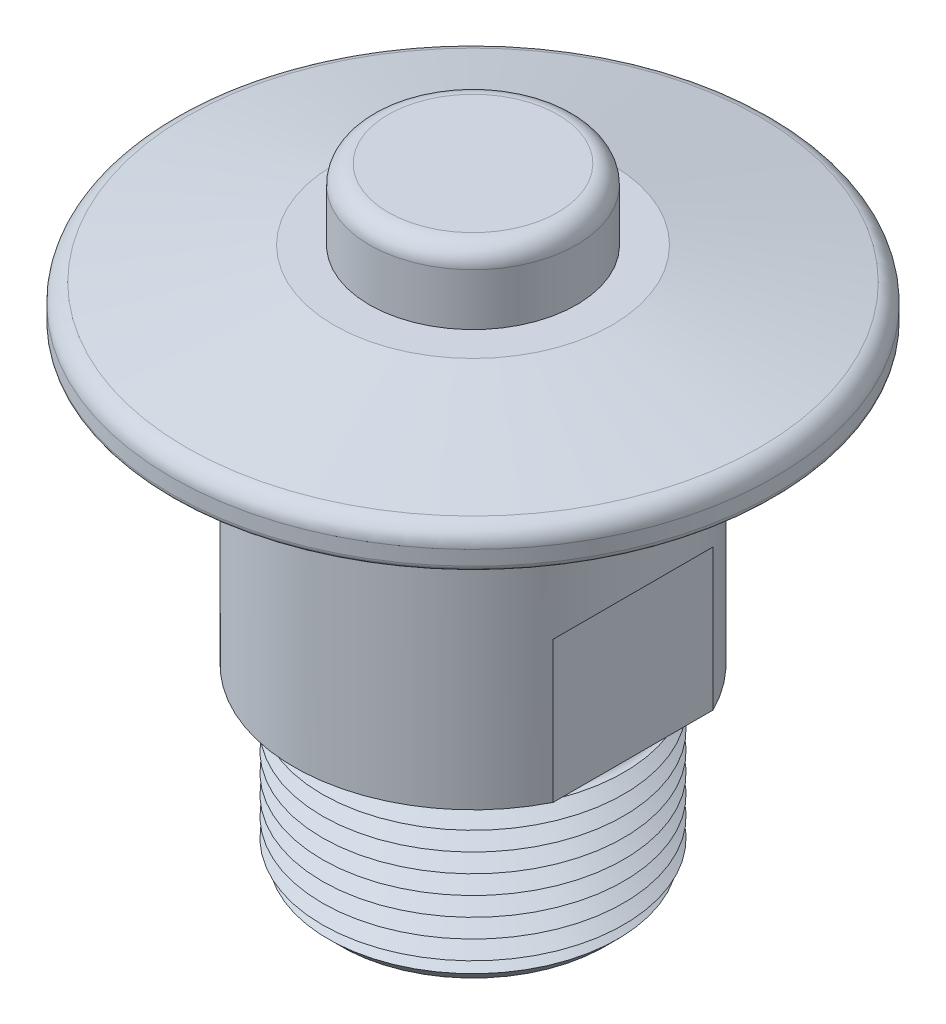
ISO-10303-21;
HEADER;
FILE_DESCRIPTION(('STEP AP214'),'2;1');
FILE_NAME('part.step','',(''),(''),'','','');
FILE_SCHEMA(('AUTOMOTIVE_DESIGN { 1 0 10303 214 1 1 1 1 }'));
ENDSEC;
DATA;
#1=APPLICATION_CONTEXT('core data for automotive mechanical design processes');
#2=APPLICATION_PROTOCOL_DEFINITION('international standard','automotive_design',2000,#1);
#3=PRODUCT_CONTEXT('',#1,'mechanical');
#4=PRODUCT('Part','Part','',(#3));
#5=PRODUCT_RELATED_PRODUCT_CATEGORY('part','',(#4));
#6=PRODUCT_DEFINITION_FORMATION('','',#4);
#7=PRODUCT_DEFINITION_CONTEXT('part definition',#1,'design');
#8=PRODUCT_DEFINITION('design','',#6,#7);
#9=PRODUCT_DEFINITION_SHAPE('','',#8);
#10=(LENGTH_UNIT() NAMED_UNIT(*) SI_UNIT(.MILLI.,.METRE.));
#11=(NAMED_UNIT(*) PLANE_ANGLE_UNIT() SI_UNIT($,.RADIAN.));
#12=(NAMED_UNIT(*) SI_UNIT($,.STERADIAN.) SOLID_ANGLE_UNIT());
#13=UNCERTAINTY_MEASURE_WITH_UNIT(LENGTH_MEASURE(1.E-05),#10,'distance_accuracy_value','');
#14=(GEOMETRIC_REPRESENTATION_CONTEXT(3) GLOBAL_UNCERTAINTY_ASSIGNED_CONTEXT((#13)) GLOBAL_UNIT_ASSIGNED_CONTEXT((#10,
#11,#12)) REPRESENTATION_CONTEXT('',''));
#15=CARTESIAN_POINT('',(0.,0.,0.));
#16=DIRECTION('',(0.,0.,1.));
#17=DIRECTION('',(1.,0.,0.));
#18=AXIS2_PLACEMENT_3D('',#15,#16,#17);
#19=CARTESIAN_POINT('',(0.,-15.5,0.));
#20=DIRECTION('',(0.,1.,0.));
#21=DIRECTION('',(0.,0.,1.));
#22=AXIS2_PLACEMENT_3D('',#19,#20,#21);
#23=CYLINDRICAL_SURFACE('',#22,9.5);
#24=CARTESIAN_POINT('',(0.,-2.,0.));
#25=DIRECTION('',(0.,-1.,0.));
#26=DIRECTION('',(0.,0.,-1.));
#27=AXIS2_PLACEMENT_3D('',#24,#25,#26);
#28=CIRCLE('',#27,9.5);
#29=CARTESIAN_POINT('',(0.,-2.,-9.5));
#30=VERTEX_POINT('',#29);
#31=EDGE_CURVE('E226',#30,#30,#28,.T.);
#32=ORIENTED_EDGE('',*,*,#31,.T.);
#33=EDGE_LOOP('',(#32));
#34=FACE_BOUND('',#33,.T.);
#35=DIRECTION('',(0.,-1.,0.));
#36=VECTOR('',#35,1.);
#37=CARTESIAN_POINT('',(-8.5,-7.,-4.24264068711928));
#38=LINE('',#37,#36);
#39=CARTESIAN_POINT('',(-8.5,-8.,-4.24264068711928));
#40=VERTEX_POINT('',#39);
#41=CARTESIAN_POINT('',(-8.5,-15.5,-4.24264068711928));
#42=VERTEX_POINT('',#41);
#43=EDGE_CURVE('E95',#40,#42,#38,.T.);
#44=ORIENTED_EDGE('',*,*,#43,.F.);
#45=CARTESIAN_POINT('',(0.,-16.4999999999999,0.));
#46=DIRECTION('',(0.707106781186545,0.70710678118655,0.));
#47=DIRECTION('',(-0.70710678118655,0.707106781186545,0.));
#48=AXIS2_PLACEMENT_3D('',#45,#46,#47);
#49=ELLIPSE('',#48,13.4350288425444,9.5);
#50=CARTESIAN_POINT('',(-9.50000000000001,-7.,0.));
#51=VERTEX_POINT('',#50);
#52=EDGE_CURVE('E11',#40,#51,#49,.T.);
#53=ORIENTED_EDGE('',*,*,#52,.T.);
#54=CARTESIAN_POINT('',(0.,-16.4999999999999,0.));
#55=DIRECTION('',(0.707106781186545,0.70710678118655,0.));
#56=DIRECTION('',(-0.70710678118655,0.707106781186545,0.));
#57=AXIS2_PLACEMENT_3D('',#54,#55,#56);
#58=ELLIPSE('',#57,13.4350288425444,9.5);
#59=CARTESIAN_POINT('',(-8.5,-8.,4.24264068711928));
#60=VERTEX_POINT('',#59);
#61=EDGE_CURVE('E48',#51,#60,#58,.T.);
#62=ORIENTED_EDGE('',*,*,#61,.T.);
#63=DIRECTION('',(0.,-1.,0.));
#64=VECTOR('',#63,1.);
#65=CARTESIAN_POINT('',(-8.5,-7.,4.24264068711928));
#66=LINE('',#65,#64);
#67=CARTESIAN_POINT('',(-8.5,-15.5,4.24264068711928));
#68=VERTEX_POINT('',#67);
#69=EDGE_CURVE('E86',#60,#68,#66,.T.);
#70=ORIENTED_EDGE('',*,*,#69,.T.);
#71=CARTESIAN_POINT('',(0.,-15.5,0.));
#72=DIRECTION('',(0.,1.,0.));
#73=DIRECTION('',(0.,0.,1.));
#74=AXIS2_PLACEMENT_3D('',#71,#72,#73);
#75=CIRCLE('',#74,9.5);
#76=CARTESIAN_POINT('',(8.5,-15.5,4.24264068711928));
#77=VERTEX_POINT('',#76);
#78=EDGE_CURVE('E89',#68,#77,#75,.T.);
#79=ORIENTED_EDGE('',*,*,#78,.T.);
#80=DIRECTION('',(0.,-1.,0.));
#81=VECTOR('',#80,1.);
#82=CARTESIAN_POINT('',(8.5,-7.,4.24264068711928));
#83=LINE('',#82,#81);
#84=CARTESIAN_POINT('',(8.5,-8.,4.24264068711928));
#85=VERTEX_POINT('',#84);
#86=EDGE_CURVE('E223',#85,#77,#83,.T.);
#87=ORIENTED_EDGE('',*,*,#86,.F.);
#88=CARTESIAN_POINT('',(0.,-16.4999999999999,0.));
#89=DIRECTION('',(-0.707106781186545,0.70710678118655,0.));
#90=DIRECTION('',(0.70710678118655,0.707106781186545,0.));
#91=AXIS2_PLACEMENT_3D('',#88,#89,#90);
#92=ELLIPSE('',#91,13.4350288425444,9.5);
#93=CARTESIAN_POINT('',(9.50000000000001,-7.,0.));
#94=VERTEX_POINT('',#93);
#95=EDGE_CURVE('E60',#85,#94,#92,.T.);
#96=ORIENTED_EDGE('',*,*,#95,.T.);
#97=CARTESIAN_POINT('',(0.,-16.4999999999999,0.));
#98=DIRECTION('',(-0.707106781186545,0.70710678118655,0.));
#99=DIRECTION('',(0.70710678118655,0.707106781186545,0.));
#100=AXIS2_PLACEMENT_3D('',#97,#98,#99);
#101=ELLIPSE('',#100,13.4350288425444,9.5);
#102=CARTESIAN_POINT('',(8.5,-8.,-4.24264068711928));
#103=VERTEX_POINT('',#102);
#104=EDGE_CURVE('E218',#94,#103,#101,.T.);
#105=ORIENTED_EDGE('',*,*,#104,.T.);
#106=DIRECTION('',(0.,-1.,0.));
#107=VECTOR('',#106,1.);
#108=CARTESIAN_POINT('',(8.5,-7.,-4.24264068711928));
#109=LINE('',#108,#107);
#110=CARTESIAN_POINT('',(8.5,-15.5,-4.24264068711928));
#111=VERTEX_POINT('',#110);
#112=EDGE_CURVE('E104',#103,#111,#109,.T.);
#113=ORIENTED_EDGE('',*,*,#112,.T.);
#114=EDGE_CURVE('E111',#111,#42,#75,.T.);
#115=ORIENTED_EDGE('',*,*,#114,.T.);
#116=EDGE_LOOP('',(#44,#53,#62,#70,#79,#87,#96,#105,#113,#115));
#117=FACE_BOUND('',#116,.T.);
#118=ADVANCED_FACE('F39',(#34,#117),#23,.T.);
#119=CARTESIAN_POINT('',(0.,-15.5,0.));
#120=DIRECTION('',(0.,1.,0.));
#121=DIRECTION('',(0.,0.,1.));
#122=AXIS2_PLACEMENT_3D('',#119,#120,#121);
#123=PLANE('',#122);
#124=CARTESIAN_POINT('',(0.,-15.5,0.));
#125=DIRECTION('',(0.,1.,0.));
#126=DIRECTION('',(0.,0.,1.));
#127=AXIS2_PLACEMENT_3D('',#124,#125,#126);
#128=CIRCLE('',#127,8.);
#129=CARTESIAN_POINT('',(0.,-15.5,8.));
#130=VERTEX_POINT('',#129);
#131=EDGE_CURVE('E112',#130,#130,#128,.T.);
#132=ORIENTED_EDGE('',*,*,#131,.T.);
#133=EDGE_LOOP('',(#132));
#134=FACE_BOUND('',#133,.T.);
#135=ORIENTED_EDGE('',*,*,#78,.F.);
#136=DIRECTION('',(0.,0.,1.));
#137=VECTOR('',#136,1.);
#138=CARTESIAN_POINT('',(-8.5,-15.5,4.24264068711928));
#139=LINE('',#138,#137);
#140=EDGE_CURVE('E98',#42,#68,#139,.T.);
#141=ORIENTED_EDGE('',*,*,#140,.F.);
#142=ORIENTED_EDGE('',*,*,#114,.F.);
#143=DIRECTION('',(0.,0.,-1.));
#144=VECTOR('',#143,1.);
#145=CARTESIAN_POINT('',(8.5,-15.5,-4.24264068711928));
#146=LINE('',#145,#144);
#147=EDGE_CURVE('E109',#77,#111,#146,.T.);
#148=ORIENTED_EDGE('',*,*,#147,.F.);
#149=EDGE_LOOP('',(#135,#141,#142,#148));
#150=FACE_BOUND('',#149,.T.);
#151=ADVANCED_FACE('F107',(#134,#150),#123,.F.);
#152=CARTESIAN_POINT('',(0.,-16.,0.));
#153=DIRECTION('',(0.,1.,0.));
#154=DIRECTION('',(0.,0.,1.));
#155=AXIS2_PLACEMENT_3D('',#152,#153,#154);
#156=TOROIDAL_SURFACE('',#155,8.,0.5);
#157=ORIENTED_EDGE('',*,*,#131,.F.);
#158=EDGE_LOOP('',(#157));
#159=FACE_BOUND('',#158,.T.);
#160=CARTESIAN_POINT('',(0.,-16.5,0.));
#161=DIRECTION('',(0.,1.,0.));
#162=DIRECTION('',(0.,0.,1.));
#163=AXIS2_PLACEMENT_3D('',#160,#161,#162);
#164=CIRCLE('',#163,8.);
#165=CARTESIAN_POINT('',(0.,-16.5,8.));
#166=VERTEX_POINT('',#165);
#167=EDGE_CURVE('E119',#166,#166,#164,.T.);
#168=ORIENTED_EDGE('',*,*,#167,.T.);
#169=EDGE_LOOP('',(#168));
#170=FACE_BOUND('',#169,.T.);
#171=ADVANCED_FACE('F180',(#159,#170),#156,.F.);
#172=CARTESIAN_POINT('',(0.,-17.,0.));
#173=DIRECTION('',(0.,1.,0.));
#174=DIRECTION('',(0.,0.,1.));
#175=AXIS2_PLACEMENT_3D('',#172,#173,#174);
#176=CONICAL_SURFACE('',#175,7.13397459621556,1.0471975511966);
#177=ORIENTED_EDGE('',*,*,#167,.F.);
#178=EDGE_LOOP('',(#177));
#179=FACE_BOUND('',#178,.T.);
#180=CARTESIAN_POINT('',(0.,-17.,0.));
#181=DIRECTION('',(0.,1.,0.));
#182=DIRECTION('',(0.,0.,1.));
#183=AXIS2_PLACEMENT_3D('',#180,#181,#182);
#184=CIRCLE('',#183,7.13397459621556);
#185=CARTESIAN_POINT('',(0.,-17.,7.13397459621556));
#186=VERTEX_POINT('',#185);
#187=EDGE_CURVE('E720',#186,#186,#184,.T.);
#188=ORIENTED_EDGE('',*,*,#187,.T.);
#189=EDGE_LOOP('',(#188));
#190=FACE_BOUND('',#189,.T.);
#191=ADVANCED_FACE('F575',(#179,#190),#176,.T.);
#192=CARTESIAN_POINT('',(0.,-17.5,0.));
#193=DIRECTION('',(0.,-1.,0.));
#194=DIRECTION('',(0.,0.,-1.));
#195=AXIS2_PLACEMENT_3D('',#192,#193,#194);
#196=CONICAL_SURFACE('',#195,8.,1.0471975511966);
#197=ORIENTED_EDGE('',*,*,#187,.F.);
#198=EDGE_LOOP('',(#197));
#199=FACE_BOUND('',#198,.T.);
#200=CARTESIAN_POINT('',(0.,-17.5,0.));
#201=DIRECTION('',(0.,1.,0.));
#202=DIRECTION('',(0.,0.,1.));
#203=AXIS2_PLACEMENT_3D('',#200,#201,#202);
#204=CIRCLE('',#203,8.);
#205=CARTESIAN_POINT('',(0.,-17.5,8.));
#206=VERTEX_POINT('',#205);
#207=EDGE_CURVE('E716',#206,#206,#204,.T.);
#208=ORIENTED_EDGE('',*,*,#207,.T.);
#209=EDGE_LOOP('',(#208));
#210=FACE_BOUND('',#209,.T.);
#211=ADVANCED_FACE('F565',(#199,#210),#196,.T.);
#212=CARTESIAN_POINT('',(0.,-18.,0.));
#213=DIRECTION('',(0.,1.,0.));
#214=DIRECTION('',(0.,0.,1.));
#215=AXIS2_PLACEMENT_3D('',#212,#213,#214);
#216=CONICAL_SURFACE('',#215,7.13397459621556,1.0471975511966);
#217=ORIENTED_EDGE('',*,*,#207,.F.);
#218=EDGE_LOOP('',(#217));
#219=FACE_BOUND('',#218,.T.);
#220=CARTESIAN_POINT('',(0.,-18.,0.));
#221=DIRECTION('',(0.,1.,0.));
#222=DIRECTION('',(0.,0.,1.));
#223=AXIS2_PLACEMENT_3D('',#220,#221,#222);
#224=CIRCLE('',#223,7.13397459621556);
#225=CARTESIAN_POINT('',(0.,-18.,7.13397459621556));
#226=VERTEX_POINT('',#225);
#227=EDGE_CURVE('E712',#226,#226,#224,.T.);
#228=ORIENTED_EDGE('',*,*,#227,.T.);
#229=EDGE_LOOP('',(#228));
#230=FACE_BOUND('',#229,.T.);
#231=ADVANCED_FACE('F555',(#219,#230),#216,.T.);
#232=CARTESIAN_POINT('',(0.,-18.5,0.));
#233=DIRECTION('',(0.,-1.,0.));
#234=DIRECTION('',(0.,0.,-1.));
#235=AXIS2_PLACEMENT_3D('',#232,#233,#234);
#236=CONICAL_SURFACE('',#235,8.,1.0471975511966);
#237=ORIENTED_EDGE('',*,*,#227,.F.);
#238=EDGE_LOOP('',(#237));
#239=FACE_BOUND('',#238,.T.);
#240=CARTESIAN_POINT('',(0.,-18.5,0.));
#241=DIRECTION('',(0.,1.,0.));
#242=DIRECTION('',(0.,0.,1.));
#243=AXIS2_PLACEMENT_3D('',#240,#241,#242);
#244=CIRCLE('',#243,8.);
#245=CARTESIAN_POINT('',(0.,-18.5,8.));
#246=VERTEX_POINT('',#245);
#247=EDGE_CURVE('E708',#246,#246,#244,.T.);
#248=ORIENTED_EDGE('',*,*,#247,.T.);
#249=EDGE_LOOP('',(#248));
#250=FACE_BOUND('',#249,.T.);
#251=ADVANCED_FACE('F545',(#239,#250),#236,.T.);
#252=CARTESIAN_POINT('',(0.,-19.,0.));
#253=DIRECTION('',(0.,1.,0.));
#254=DIRECTION('',(0.,0.,1.));
#255=AXIS2_PLACEMENT_3D('',#252,#253,#254);
#256=CONICAL_SURFACE('',#255,7.13397459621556,1.0471975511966);
#257=ORIENTED_EDGE('',*,*,#247,.F.);
#258=EDGE_LOOP('',(#257));
#259=FACE_BOUND('',#258,.T.);
#260=CARTESIAN_POINT('',(0.,-19.,0.));
#261=DIRECTION('',(0.,1.,0.));
#262=DIRECTION('',(0.,0.,1.));
#263=AXIS2_PLACEMENT_3D('',#260,#261,#262);
#264=CIRCLE('',#263,7.13397459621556);
#265=CARTESIAN_POINT('',(0.,-19.,7.13397459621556));
#266=VERTEX_POINT('',#265);
#267=EDGE_CURVE('E705',#266,#266,#264,.T.);
#268=ORIENTED_EDGE('',*,*,#267,.T.);
#269=EDGE_LOOP('',(#268));
#270=FACE_BOUND('',#269,.T.);
#271=ADVANCED_FACE('F535',(#259,#270),#256,.T.);
#272=CARTESIAN_POINT('',(0.,-19.5,0.));
#273=DIRECTION('',(0.,-1.,0.));
#274=DIRECTION('',(0.,0.,-1.));
#275=AXIS2_PLACEMENT_3D('',#272,#273,#274);
#276=CONICAL_SURFACE('',#275,8.,1.0471975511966);
#277=ORIENTED_EDGE('',*,*,#267,.F.);
#278=EDGE_LOOP('',(#277));
#279=FACE_BOUND('',#278,.T.);
#280=CARTESIAN_POINT('',(0.,-19.5,0.));
#281=DIRECTION('',(0.,1.,0.));
#282=DIRECTION('',(0.,0.,1.));
#283=AXIS2_PLACEMENT_3D('',#280,#281,#282);
#284=CIRCLE('',#283,8.);
#285=CARTESIAN_POINT('',(0.,-19.5,8.));
#286=VERTEX_POINT('',#285);
#287=EDGE_CURVE('E702',#286,#286,#284,.T.);
#288=ORIENTED_EDGE('',*,*,#287,.T.);
#289=EDGE_LOOP('',(#288));
#290=FACE_BOUND('',#289,.T.);
#291=ADVANCED_FACE('F525',(#279,#290),#276,.T.);
#292=CARTESIAN_POINT('',(0.,-20.,0.));
#293=DIRECTION('',(0.,1.,0.));
#294=DIRECTION('',(0.,0.,1.));
#295=AXIS2_PLACEMENT_3D('',#292,#293,#294);
#296=CONICAL_SURFACE('',#295,7.13397459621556,1.0471975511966);
#297=ORIENTED_EDGE('',*,*,#287,.F.);
#298=EDGE_LOOP('',(#297));
#299=FACE_BOUND('',#298,.T.);
#300=CARTESIAN_POINT('',(0.,-20.,0.));
#301=DIRECTION('',(0.,1.,0.));
#302=DIRECTION('',(0.,0.,1.));
#303=AXIS2_PLACEMENT_3D('',#300,#301,#302);
#304=CIRCLE('',#303,7.13397459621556);
#305=CARTESIAN_POINT('',(0.,-20.,7.13397459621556));
#306=VERTEX_POINT('',#305);
#307=EDGE_CURVE('E698',#306,#306,#304,.T.);
#308=ORIENTED_EDGE('',*,*,#307,.T.);
#309=EDGE_LOOP('',(#308));
#310=FACE_BOUND('',#309,.T.);
#311=ADVANCED_FACE('F515',(#299,#310),#296,.T.);
#312=CARTESIAN_POINT('',(0.,-20.5,0.));
#313=DIRECTION('',(0.,-1.,0.));
#314=DIRECTION('',(0.,0.,-1.));
#315=AXIS2_PLACEMENT_3D('',#312,#313,#314);
#316=CONICAL_SURFACE('',#315,8.,1.0471975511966);
#317=ORIENTED_EDGE('',*,*,#307,.F.);
#318=EDGE_LOOP('',(#317));
#319=FACE_BOUND('',#318,.T.);
#320=CARTESIAN_POINT('',(0.,-20.5,0.));
#321=DIRECTION('',(0.,1.,0.));
#322=DIRECTION('',(0.,0.,1.));
#323=AXIS2_PLACEMENT_3D('',#320,#321,#322);
#324=CIRCLE('',#323,8.);
#325=CARTESIAN_POINT('',(0.,-20.5,8.));
#326=VERTEX_POINT('',#325);
#327=EDGE_CURVE('E694',#326,#326,#324,.T.);
#328=ORIENTED_EDGE('',*,*,#327,.T.);
#329=EDGE_LOOP('',(#328));
#330=FACE_BOUND('',#329,.T.);
#331=ADVANCED_FACE('F505',(#319,#330),#316,.T.);
#332=CARTESIAN_POINT('',(0.,-21.,0.));
#333=DIRECTION('',(0.,1.,0.));
#334=DIRECTION('',(0.,0.,1.));
#335=AXIS2_PLACEMENT_3D('',#332,#333,#334);
#336=CONICAL_SURFACE('',#335,7.13397459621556,1.0471975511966);
#337=ORIENTED_EDGE('',*,*,#327,.F.);
#338=EDGE_LOOP('',(#337));
#339=FACE_BOUND('',#338,.T.);
#340=CARTESIAN_POINT('',(0.,-21.,0.));
#341=DIRECTION('',(0.,1.,0.));
#342=DIRECTION('',(0.,0.,1.));
#343=AXIS2_PLACEMENT_3D('',#340,#341,#342);
#344=CIRCLE('',#343,7.13397459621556);
#345=CARTESIAN_POINT('',(0.,-21.,7.13397459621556));
#346=VERTEX_POINT('',#345);
#347=EDGE_CURVE('E690',#346,#346,#344,.T.);
#348=ORIENTED_EDGE('',*,*,#347,.T.);
#349=EDGE_LOOP('',(#348));
#350=FACE_BOUND('',#349,.T.);
#351=ADVANCED_FACE('F495',(#339,#350),#336,.T.);
#352=CARTESIAN_POINT('',(0.,-21.5,0.));
#353=DIRECTION('',(0.,-1.,0.));
#354=DIRECTION('',(0.,0.,-1.));
#355=AXIS2_PLACEMENT_3D('',#352,#353,#354);
#356=CONICAL_SURFACE('',#355,8.,1.0471975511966);
#357=ORIENTED_EDGE('',*,*,#347,.F.);
#358=EDGE_LOOP('',(#357));
#359=FACE_BOUND('',#358,.T.);
#360=CARTESIAN_POINT('',(0.,-21.5,0.));
#361=DIRECTION('',(0.,1.,0.));
#362=DIRECTION('',(0.,0.,1.));
#363=AXIS2_PLACEMENT_3D('',#360,#361,#362);
#364=CIRCLE('',#363,8.);
#365=CARTESIAN_POINT('',(0.,-21.5,8.));
#366=VERTEX_POINT('',#365);
#367=EDGE_CURVE('E686',#366,#366,#364,.T.);
#368=ORIENTED_EDGE('',*,*,#367,.T.);
#369=EDGE_LOOP('',(#368));
#370=FACE_BOUND('',#369,.T.);
#371=ADVANCED_FACE('F485',(#359,#370),#356,.T.);
#372=CARTESIAN_POINT('',(0.,-22.,0.));
#373=DIRECTION('',(0.,1.,0.));
#374=DIRECTION('',(0.,0.,1.));
#375=AXIS2_PLACEMENT_3D('',#372,#373,#374);
#376=CONICAL_SURFACE('',#375,7.13397459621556,1.0471975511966);
#377=ORIENTED_EDGE('',*,*,#367,.F.);
#378=EDGE_LOOP('',(#377));
#379=FACE_BOUND('',#378,.T.);
#380=CARTESIAN_POINT('',(0.,-22.,0.));
#381=DIRECTION('',(0.,1.,0.));
#382=DIRECTION('',(0.,0.,1.));
#383=AXIS2_PLACEMENT_3D('',#380,#381,#382);
#384=CIRCLE('',#383,7.13397459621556);
#385=CARTESIAN_POINT('',(0.,-22.,7.13397459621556));
#386=VERTEX_POINT('',#385);
#387=EDGE_CURVE('E682',#386,#386,#384,.T.);
#388=ORIENTED_EDGE('',*,*,#387,.T.);
#389=EDGE_LOOP('',(#388));
#390=FACE_BOUND('',#389,.T.);
#391=ADVANCED_FACE('F475',(#379,#390),#376,.T.);
#392=CARTESIAN_POINT('',(0.,-22.5,0.));
#393=DIRECTION('',(0.,-1.,0.));
#394=DIRECTION('',(0.,0.,-1.));
#395=AXIS2_PLACEMENT_3D('',#392,#393,#394);
#396=CONICAL_SURFACE('',#395,8.,1.0471975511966);
#397=ORIENTED_EDGE('',*,*,#387,.F.);
#398=EDGE_LOOP('',(#397));
#399=FACE_BOUND('',#398,.T.);
#400=CARTESIAN_POINT('',(0.,-22.5,0.));
#401=DIRECTION('',(0.,1.,0.));
#402=DIRECTION('',(0.,0.,1.));
#403=AXIS2_PLACEMENT_3D('',#400,#401,#402);
#404=CIRCLE('',#403,8.);
#405=CARTESIAN_POINT('',(0.,-22.5,8.));
#406=VERTEX_POINT('',#405);
#407=EDGE_CURVE('E678',#406,#406,#404,.T.);
#408=ORIENTED_EDGE('',*,*,#407,.T.);
#409=EDGE_LOOP('',(#408));
#410=FACE_BOUND('',#409,.T.);
#411=ADVANCED_FACE('F465',(#399,#410),#396,.T.);
#412=CARTESIAN_POINT('',(0.,-23.,0.));
#413=DIRECTION('',(0.,1.,0.));
#414=DIRECTION('',(0.,0.,1.));
#415=AXIS2_PLACEMENT_3D('',#412,#413,#414);
#416=CONICAL_SURFACE('',#415,7.13397459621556,1.0471975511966);
#417=ORIENTED_EDGE('',*,*,#407,.F.);
#418=EDGE_LOOP('',(#417));
#419=FACE_BOUND('',#418,.T.);
#420=CARTESIAN_POINT('',(0.,-23.,0.));
#421=DIRECTION('',(0.,1.,0.));
#422=DIRECTION('',(0.,0.,1.));
#423=AXIS2_PLACEMENT_3D('',#420,#421,#422);
#424=CIRCLE('',#423,7.13397459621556);
#425=CARTESIAN_POINT('',(0.,-23.,7.13397459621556));
#426=VERTEX_POINT('',#425);
#427=EDGE_CURVE('E131',#426,#426,#424,.T.);
#428=ORIENTED_EDGE('',*,*,#427,.T.);
#429=EDGE_LOOP('',(#428));
#430=FACE_BOUND('',#429,.T.);
#431=ADVANCED_FACE('F455',(#419,#430),#416,.T.);
#432=CARTESIAN_POINT('',(0.,-23.5,0.));
#433=DIRECTION('',(0.,-1.,0.));
#434=DIRECTION('',(0.,0.,-1.));
#435=AXIS2_PLACEMENT_3D('',#432,#433,#434);
#436=CONICAL_SURFACE('',#435,8.,1.0471975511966);
#437=ORIENTED_EDGE('',*,*,#427,.F.);
#438=EDGE_LOOP('',(#437));
#439=FACE_BOUND('',#438,.T.);
#440=CARTESIAN_POINT('',(0.,-23.5,0.));
#441=DIRECTION('',(0.,1.,0.));
#442=DIRECTION('',(0.,0.,1.));
#443=AXIS2_PLACEMENT_3D('',#440,#441,#442);
#444=CIRCLE('',#443,8.);
#445=CARTESIAN_POINT('',(0.,-23.5,8.));
#446=VERTEX_POINT('',#445);
#447=EDGE_CURVE('E132',#446,#446,#444,.T.);
#448=ORIENTED_EDGE('',*,*,#447,.T.);
#449=EDGE_LOOP('',(#448));
#450=FACE_BOUND('',#449,.T.);
#451=ADVANCED_FACE('F445',(#439,#450),#436,.T.);
#452=CARTESIAN_POINT('',(0.,-24.,0.));
#453=DIRECTION('',(0.,1.,0.));
#454=DIRECTION('',(0.,0.,1.));
#455=AXIS2_PLACEMENT_3D('',#452,#453,#454);
#456=CONICAL_SURFACE('',#455,7.13397459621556,1.0471975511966);
#457=ORIENTED_EDGE('',*,*,#447,.F.);
#458=EDGE_LOOP('',(#457));
#459=FACE_BOUND('',#458,.T.);
#460=CARTESIAN_POINT('',(0.,-24.,0.));
#461=DIRECTION('',(0.,1.,0.));
#462=DIRECTION('',(0.,0.,1.));
#463=AXIS2_PLACEMENT_3D('',#460,#461,#462);
#464=CIRCLE('',#463,7.13397459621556);
#465=CARTESIAN_POINT('',(0.,-24.,7.13397459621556));
#466=VERTEX_POINT('',#465);
#467=EDGE_CURVE('E664',#466,#466,#464,.T.);
#468=ORIENTED_EDGE('',*,*,#467,.T.);
#469=EDGE_LOOP('',(#468));
#470=FACE_BOUND('',#469,.T.);
#471=ADVANCED_FACE('F435',(#459,#470),#456,.T.);
#472=CARTESIAN_POINT('',(0.,-24.5,0.));
#473=DIRECTION('',(0.,-1.,0.));
#474=DIRECTION('',(0.,0.,-1.));
#475=AXIS2_PLACEMENT_3D('',#472,#473,#474);
#476=CONICAL_SURFACE('',#475,8.,1.0471975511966);
#477=CARTESIAN_POINT('',(0.,-24.3169872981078,0.));
#478=DIRECTION('',(0.,-1.,0.));
#479=DIRECTION('',(0.,0.,-1.));
#480=AXIS2_PLACEMENT_3D('',#477,#478,#479);
#481=CIRCLE('',#480,7.68301270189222);
#482=CARTESIAN_POINT('',(0.,-24.3169872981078,-7.68301270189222));
#483=VERTEX_POINT('',#482);
#484=EDGE_CURVE('E127',#483,#483,#481,.F.);
#485=ORIENTED_EDGE('',*,*,#484,.T.);
#486=EDGE_LOOP('',(#485));
#487=FACE_BOUND('',#486,.T.);
#488=ORIENTED_EDGE('',*,*,#467,.F.);
#489=EDGE_LOOP('',(#488));
#490=FACE_BOUND('',#489,.T.);
#491=ADVANCED_FACE('F429',(#487,#490),#476,.T.);
#492=CARTESIAN_POINT('',(0.,-25.,0.));
#493=DIRECTION('',(0.,-1.,0.));
#494=DIRECTION('',(0.,0.,-1.));
#495=AXIS2_PLACEMENT_3D('',#492,#493,#494);
#496=PLANE('',#495);
#497=CARTESIAN_POINT('',(0.,-25.,0.));
#498=DIRECTION('',(0.,-1.,0.));
#499=DIRECTION('',(0.,0.,-1.));
#500=AXIS2_PLACEMENT_3D('',#497,#498,#499);
#501=CIRCLE('',#500,3.50000000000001);
#502=CARTESIAN_POINT('',(0.,-25.,-3.50000000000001));
#503=VERTEX_POINT('',#502);
#504=EDGE_CURVE('E136',#503,#503,#501,.F.);
#505=ORIENTED_EDGE('',*,*,#504,.T.);
#506=EDGE_LOOP('',(#505));
#507=FACE_BOUND('',#506,.T.);
#508=CARTESIAN_POINT('',(0.,-25.,0.));
#509=DIRECTION('',(0.,-1.,0.));
#510=DIRECTION('',(0.,0.,-1.));
#511=AXIS2_PLACEMENT_3D('',#508,#509,#510);
#512=CIRCLE('',#511,7.);
#513=CARTESIAN_POINT('',(0.,-25.,-7.));
#514=VERTEX_POINT('',#513);
#515=EDGE_CURVE('E116',#514,#514,#512,.T.);
#516=ORIENTED_EDGE('',*,*,#515,.T.);
#517=EDGE_LOOP('',(#516));
#518=FACE_BOUND('',#517,.T.);
#519=ADVANCED_FACE('F188',(#507,#518),#496,.T.);
#520=CARTESIAN_POINT('',(0.,-25.,0.));
#521=DIRECTION('',(0.,1.,0.));
#522=DIRECTION('',(0.,0.,1.));
#523=AXIS2_PLACEMENT_3D('',#520,#521,#522);
#524=CONICAL_SURFACE('',#523,7.,0.785398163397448);
#525=ORIENTED_EDGE('',*,*,#484,.F.);
#526=EDGE_LOOP('',(#525));
#527=FACE_BOUND('',#526,.T.);
#528=ORIENTED_EDGE('',*,*,#515,.F.);
#529=EDGE_LOOP('',(#528));
#530=FACE_BOUND('',#529,.T.);
#531=ADVANCED_FACE('F186',(#527,#530),#524,.T.);
#532=CARTESIAN_POINT('',(0.,-19.,0.));
#533=DIRECTION('',(0.,-1.,0.));
#534=DIRECTION('',(0.,0.,-1.));
#535=AXIS2_PLACEMENT_3D('',#532,#533,#534);
#536=CYLINDRICAL_SURFACE('',#535,3.);
#537=CARTESIAN_POINT('',(-0.986013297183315,-22.,-2.83333333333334));
#538=CARTESIAN_POINT('',(-0.986013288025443,-21.9442171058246,-2.83333333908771));
#539=CARTESIAN_POINT('',(-0.981533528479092,-21.8884341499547,-2.83490424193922));
#540=CARTESIAN_POINT('',(-0.963720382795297,-21.778467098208,-2.84100865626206));
#541=CARTESIAN_POINT('',(-0.950386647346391,-21.7242830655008,-2.84554228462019));
#542=CARTESIAN_POINT('',(-0.915186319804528,-21.6190661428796,-2.85705690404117));
#543=CARTESIAN_POINT('',(-0.893323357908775,-21.5680319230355,-2.86403685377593));
#544=CARTESIAN_POINT('',(-0.841573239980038,-21.4704868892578,-2.87966698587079));
#545=CARTESIAN_POINT('',(-0.811685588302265,-21.4239763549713,-2.88831727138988));
#546=CARTESIAN_POINT('',(-0.744354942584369,-21.3364282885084,-2.9063991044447));
#547=CARTESIAN_POINT('',(-0.706860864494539,-21.2954310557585,-2.91583566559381));
#548=CARTESIAN_POINT('',(-0.625372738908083,-21.2204120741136,-2.93439113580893));
#549=CARTESIAN_POINT('',(-0.581378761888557,-21.1863902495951,-2.94351004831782));
#550=CARTESIAN_POINT('',(-0.488223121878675,-21.126388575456,-2.96038289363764));
#551=CARTESIAN_POINT('',(-0.439082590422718,-21.1003774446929,-2.96814208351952));
#552=CARTESIAN_POINT('',(-0.336857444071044,-21.0569672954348,-2.98147278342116));
#553=CARTESIAN_POINT('',(-0.283773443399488,-21.03956693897,-2.98704463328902));
#554=CARTESIAN_POINT('',(-0.17658309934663,-21.0142159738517,-2.99526877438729));
#555=CARTESIAN_POINT('',(-0.122535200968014,-21.0060406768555,-2.99799036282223));
#556=CARTESIAN_POINT('',(-0.0137652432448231,-20.9986097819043,-3.00046128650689));
#557=CARTESIAN_POINT('',(0.0409567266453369,-20.999353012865,-3.00021101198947));
#558=CARTESIAN_POINT('',(0.148373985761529,-21.0096306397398,-2.99680115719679));
#559=CARTESIAN_POINT('',(0.201087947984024,-21.0189905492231,-2.99369932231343));
#560=CARTESIAN_POINT('',(0.304130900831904,-21.0459901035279,-2.98499233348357));
#561=CARTESIAN_POINT('',(0.354459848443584,-21.0636298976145,-2.97938713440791));
#562=CARTESIAN_POINT('',(0.45174028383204,-21.1068671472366,-2.9662029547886));
#563=CARTESIAN_POINT('',(0.498664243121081,-21.1325221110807,-2.9586097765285));
#564=CARTESIAN_POINT('',(0.587529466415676,-21.1910665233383,-2.94225314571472));
#565=CARTESIAN_POINT('',(0.629470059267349,-21.2239569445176,-2.93348953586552));
#566=CARTESIAN_POINT('',(0.708380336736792,-21.2970769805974,-2.91545545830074));
#567=CARTESIAN_POINT('',(0.745191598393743,-21.3374758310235,-2.90617773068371));
#568=CARTESIAN_POINT('',(0.811628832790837,-21.4239432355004,-2.88832916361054));
#569=CARTESIAN_POINT('',(0.841254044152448,-21.470012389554,-2.8797583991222));
#570=CARTESIAN_POINT('',(0.89307174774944,-21.5674308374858,-2.86411785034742));
#571=CARTESIAN_POINT('',(0.915128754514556,-21.6188568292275,-2.85707618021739));
#572=CARTESIAN_POINT('',(0.950573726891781,-21.7248796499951,-2.84548063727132));
#573=CARTESIAN_POINT('',(0.963962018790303,-21.7794763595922,-2.84092667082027));
#574=CARTESIAN_POINT('',(0.981706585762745,-21.8899950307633,-2.83484408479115));
#575=CARTESIAN_POINT('',(0.986108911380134,-21.9459087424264,-2.83330004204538));
#576=CARTESIAN_POINT('',(0.985914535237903,-22.0577168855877,-2.83336772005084));
#577=CARTESIAN_POINT('',(0.981318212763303,-22.1136113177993,-2.83497930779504));
#578=CARTESIAN_POINT('',(0.963306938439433,-22.2233461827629,-2.84114904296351));
#579=CARTESIAN_POINT('',(0.949960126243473,-22.2771991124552,-2.8456844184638));
#580=CARTESIAN_POINT('',(0.914824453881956,-22.3818035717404,-2.85717262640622));
#581=CARTESIAN_POINT('',(0.893035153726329,-22.4325549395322,-2.86412558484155));
#582=CARTESIAN_POINT('',(0.841332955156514,-22.5299218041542,-2.87973785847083));
#583=CARTESIAN_POINT('',(0.8113632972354,-22.5765052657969,-2.88840897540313));
#584=CARTESIAN_POINT('',(0.744076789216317,-22.6638700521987,-2.90646860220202));
#585=CARTESIAN_POINT('',(0.706759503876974,-22.7046510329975,-2.91585715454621));
#586=CARTESIAN_POINT('',(0.625437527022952,-22.7795395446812,-2.93437797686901));
#587=CARTESIAN_POINT('',(0.581393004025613,-22.8136043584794,-2.94350830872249));
#588=CARTESIAN_POINT('',(0.487941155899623,-22.8737892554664,-2.96043312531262));
#589=CARTESIAN_POINT('',(0.438534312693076,-22.8999100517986,-2.96822772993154));
#590=CARTESIAN_POINT('',(0.336571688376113,-22.9430993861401,-2.98149591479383));
#591=CARTESIAN_POINT('',(0.284079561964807,-22.9603071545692,-2.98700490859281));
#592=CARTESIAN_POINT('',(0.176763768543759,-22.9857938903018,-2.99527086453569));
#593=CARTESIAN_POINT('',(0.121940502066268,-22.9940743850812,-2.99802829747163));
#594=CARTESIAN_POINT('',(0.0130747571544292,-23.0013630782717,-3.00045258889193));
#595=CARTESIAN_POINT('',(-0.0409500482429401,-23.0006106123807,-3.00019922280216));
#596=CARTESIAN_POINT('',(-0.1480816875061,-22.9904338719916,-2.99682228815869));
#597=CARTESIAN_POINT('',(-0.201188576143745,-22.9810101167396,-2.99369889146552));
#598=CARTESIAN_POINT('',(-0.304599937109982,-22.9538599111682,-2.98494460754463));
#599=CARTESIAN_POINT('',(-0.354921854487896,-22.9361938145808,-2.97933196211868));
#600=CARTESIAN_POINT('',(-0.451830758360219,-22.893063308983,-2.96618317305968));
#601=CARTESIAN_POINT('',(-0.498417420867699,-22.8675982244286,-2.95864686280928));
#602=CARTESIAN_POINT('',(-0.587547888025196,-22.8089639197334,-2.94225817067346));
#603=CARTESIAN_POINT('',(-0.629994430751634,-22.7756533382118,-2.93338286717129));
#604=CARTESIAN_POINT('',(-0.708745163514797,-22.7024864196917,-2.91535856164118));
#605=CARTESIAN_POINT('',(-0.745048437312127,-22.6626291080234,-2.90620951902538));
#606=CARTESIAN_POINT('',(-0.811489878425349,-22.5763196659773,-2.88837324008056));
#607=CARTESIAN_POINT('',(-0.841450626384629,-22.5297272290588,-2.87970333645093));
#608=CARTESIAN_POINT('',(-0.893316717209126,-22.4319975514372,-2.86403954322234));
#609=CARTESIAN_POINT('',(-0.915222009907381,-22.3808602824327,-2.85704566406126));
#610=CARTESIAN_POINT('',(-0.950427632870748,-22.2755612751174,-2.84552843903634));
#611=CARTESIAN_POINT('',(-0.963746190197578,-22.221406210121,-2.84099986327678));
#612=CARTESIAN_POINT('',(-0.98153878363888,-22.1115007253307,-2.83490238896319));
#613=CARTESIAN_POINT('',(-0.986013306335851,-22.0557503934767,-2.83333332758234));
#614=CARTESIAN_POINT('',(-0.986013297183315,-22.,-2.83333333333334));
#615=B_SPLINE_CURVE_WITH_KNOTS('',3,(#537,#538,#539,#540,#541,#542,#543,#544,#545,#546,#547,
#548,#549,#550,#551,#552,#553,#554,#555,#556,#557,#558,#559,#560,#561,#562,#563,#564,#565,#566,
#567,#568,#569,#570,#571,#572,#573,#574,#575,#576,#577,#578,#579,#580,#581,#582,#583,#584,#585,
#586,#587,#588,#589,#590,#591,#592,#593,#594,#595,#596,#597,#598,#599,#600,#601,#602,#603,#604,
#605,#606,#607,#608,#609,#610,#611,#612,#613,#614),.UNSPECIFIED.,.T.,.F.,(4,2,2,2,2,2,2,2,2,2,2,
2,2,2,2,2,2,2,2,2,2,2,2,2,2,2,2,2,2,2,2,2,2,2,2,2,2,2,4),(0.,0.167149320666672,
0.334305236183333,0.501390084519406,0.668485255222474,0.836742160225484,1.00499724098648,
1.17258671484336,1.34015013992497,1.50353776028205,1.66690392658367,1.82703303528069,
1.98716503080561,2.14847342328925,2.30980351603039,2.4753468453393,2.64090770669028,
2.80929423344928,2.97767442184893,3.14518952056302,3.31269755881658,3.47891646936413,
3.64514404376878,3.81255567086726,3.97997721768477,4.14843150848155,4.31687067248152,
4.48259263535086,4.64828623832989,4.80959956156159,4.97090322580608,5.13104386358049,
5.29119837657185,5.45449533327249,5.61781662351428,5.78523326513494,5.95265094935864,
6.11971207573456,6.28676401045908),.UNSPECIFIED.);
#616=CARTESIAN_POINT('',(-0.986013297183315,-22.,-2.83333333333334));
#617=VERTEX_POINT('',#616);
#618=EDGE_CURVE('E244',#617,#617,#615,.T.);
#619=ORIENTED_EDGE('',*,*,#618,.T.);
#620=EDGE_LOOP('',(#619));
#621=FACE_BOUND('',#620,.T.);
#622=CARTESIAN_POINT('',(-2.83333333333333,-22.,0.986013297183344));
#623=CARTESIAN_POINT('',(-2.83333333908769,-21.9442171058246,0.986013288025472));
#624=CARTESIAN_POINT('',(-2.83490424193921,-21.8884341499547,0.981533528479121));
#625=CARTESIAN_POINT('',(-2.84100865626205,-21.778467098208,0.963720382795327));
#626=CARTESIAN_POINT('',(-2.84554228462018,-21.7242830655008,0.950386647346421));
#627=CARTESIAN_POINT('',(-2.85705690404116,-21.6190661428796,0.915186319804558));
#628=CARTESIAN_POINT('',(-2.86403685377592,-21.5680319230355,0.893323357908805));
#629=CARTESIAN_POINT('',(-2.87966698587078,-21.4704868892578,0.841573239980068));
#630=CARTESIAN_POINT('',(-2.88831727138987,-21.4239763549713,0.811685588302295));
#631=CARTESIAN_POINT('',(-2.90639910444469,-21.3364282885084,0.744354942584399));
#632=CARTESIAN_POINT('',(-2.91583566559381,-21.2954310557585,0.706860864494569));
#633=CARTESIAN_POINT('',(-2.93439113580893,-21.2204120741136,0.625372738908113));
#634=CARTESIAN_POINT('',(-2.94351004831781,-21.1863902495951,0.581378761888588));
#635=CARTESIAN_POINT('',(-2.96038289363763,-21.126388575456,0.488223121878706));
#636=CARTESIAN_POINT('',(-2.96814208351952,-21.1003774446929,0.439082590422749));
#637=CARTESIAN_POINT('',(-2.98147278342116,-21.0569672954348,0.336857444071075));
#638=CARTESIAN_POINT('',(-2.98704463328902,-21.03956693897,0.28377344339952));
#639=CARTESIAN_POINT('',(-2.99526877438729,-21.0142159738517,0.176583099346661));
#640=CARTESIAN_POINT('',(-2.99799036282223,-21.0060406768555,0.122535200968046));
#641=CARTESIAN_POINT('',(-3.00046128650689,-20.9986097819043,0.0137652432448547));
#642=CARTESIAN_POINT('',(-3.00021101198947,-20.999353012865,-0.0409567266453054));
#643=CARTESIAN_POINT('',(-2.99680115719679,-21.0096306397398,-0.148373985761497));
#644=CARTESIAN_POINT('',(-2.99369932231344,-21.0189905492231,-0.201087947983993));
#645=CARTESIAN_POINT('',(-2.98499233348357,-21.0459901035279,-0.304130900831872));
#646=CARTESIAN_POINT('',(-2.97938713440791,-21.0636298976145,-0.354459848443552));
#647=CARTESIAN_POINT('',(-2.9662029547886,-21.1068671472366,-0.451740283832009));
#648=CARTESIAN_POINT('',(-2.9586097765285,-21.1325221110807,-0.49866424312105));
#649=CARTESIAN_POINT('',(-2.94225314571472,-21.1910665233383,-0.587529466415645));
#650=CARTESIAN_POINT('',(-2.93348953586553,-21.2239569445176,-0.629470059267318));
#651=CARTESIAN_POINT('',(-2.91545545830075,-21.2970769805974,-0.708380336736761));
#652=CARTESIAN_POINT('',(-2.90617773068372,-21.3374758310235,-0.745191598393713));
#653=CARTESIAN_POINT('',(-2.88832916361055,-21.4239432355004,-0.811628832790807));
#654=CARTESIAN_POINT('',(-2.8797583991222,-21.470012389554,-0.841254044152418));
#655=CARTESIAN_POINT('',(-2.86411785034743,-21.5674308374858,-0.89307174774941));
#656=CARTESIAN_POINT('',(-2.8570761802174,-21.6188568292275,-0.915128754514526));
#657=CARTESIAN_POINT('',(-2.84548063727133,-21.7248796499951,-0.950573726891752));
#658=CARTESIAN_POINT('',(-2.84092667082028,-21.7794763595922,-0.963962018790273));
#659=CARTESIAN_POINT('',(-2.83484408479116,-21.8899950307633,-0.981706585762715));
#660=CARTESIAN_POINT('',(-2.83330004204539,-21.9459087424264,-0.986108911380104));
#661=CARTESIAN_POINT('',(-2.83336772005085,-22.0577168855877,-0.985914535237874));
#662=CARTESIAN_POINT('',(-2.83497930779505,-22.1136113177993,-0.981318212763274));
#663=CARTESIAN_POINT('',(-2.84114904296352,-22.2233461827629,-0.963306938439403));
#664=CARTESIAN_POINT('',(-2.84568441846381,-22.2771991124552,-0.949960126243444));
#665=CARTESIAN_POINT('',(-2.85717262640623,-22.3818035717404,-0.914824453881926));
#666=CARTESIAN_POINT('',(-2.86412558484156,-22.4325549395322,-0.893035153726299));
#667=CARTESIAN_POINT('',(-2.87973785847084,-22.5299218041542,-0.841332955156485));
#668=CARTESIAN_POINT('',(-2.88840897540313,-22.5765052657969,-0.811363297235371));
#669=CARTESIAN_POINT('',(-2.90646860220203,-22.6638700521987,-0.744076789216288));
#670=CARTESIAN_POINT('',(-2.91585715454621,-22.7046510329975,-0.706759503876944));
#671=CARTESIAN_POINT('',(-2.93437797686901,-22.7795395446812,-0.625437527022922));
#672=CARTESIAN_POINT('',(-2.9435083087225,-22.8136043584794,-0.581393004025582));
#673=CARTESIAN_POINT('',(-2.96043312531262,-22.8737892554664,-0.487941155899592));
#674=CARTESIAN_POINT('',(-2.96822772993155,-22.8999100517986,-0.438534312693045));
#675=CARTESIAN_POINT('',(-2.98149591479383,-22.9430993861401,-0.336571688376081));
#676=CARTESIAN_POINT('',(-2.98700490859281,-22.9603071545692,-0.284079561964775));
#677=CARTESIAN_POINT('',(-2.99527086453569,-22.9857938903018,-0.176763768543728));
#678=CARTESIAN_POINT('',(-2.99802829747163,-22.9940743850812,-0.121940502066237));
#679=CARTESIAN_POINT('',(-3.00045258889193,-23.0013630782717,-0.0130747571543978));
#680=CARTESIAN_POINT('',(-3.00019922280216,-23.0006106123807,0.0409500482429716));
#681=CARTESIAN_POINT('',(-2.99682228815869,-22.9904338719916,0.148081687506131));
#682=CARTESIAN_POINT('',(-2.99369889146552,-22.9810101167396,0.201188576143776));
#683=CARTESIAN_POINT('',(-2.98494460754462,-22.9538599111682,0.304599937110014));
#684=CARTESIAN_POINT('',(-2.97933196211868,-22.9361938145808,0.354921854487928));
#685=CARTESIAN_POINT('',(-2.96618317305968,-22.893063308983,0.45183075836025));
#686=CARTESIAN_POINT('',(-2.95864686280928,-22.8675982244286,0.49841742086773));
#687=CARTESIAN_POINT('',(-2.94225817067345,-22.8089639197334,0.587547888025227));
#688=CARTESIAN_POINT('',(-2.93338286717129,-22.7756533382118,0.629994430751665));
#689=CARTESIAN_POINT('',(-2.91535856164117,-22.7024864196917,0.708745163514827));
#690=CARTESIAN_POINT('',(-2.90620951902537,-22.6626291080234,0.745048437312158));
#691=CARTESIAN_POINT('',(-2.88837324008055,-22.5763196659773,0.811489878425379));
#692=CARTESIAN_POINT('',(-2.87970333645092,-22.5297272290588,0.841450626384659));
#693=CARTESIAN_POINT('',(-2.86403954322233,-22.4319975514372,0.893316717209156));
#694=CARTESIAN_POINT('',(-2.85704566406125,-22.3808602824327,0.915222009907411));
#695=CARTESIAN_POINT('',(-2.84552843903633,-22.2755612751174,0.950427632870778));
#696=CARTESIAN_POINT('',(-2.84099986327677,-22.221406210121,0.963746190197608));
#697=CARTESIAN_POINT('',(-2.83490238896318,-22.1115007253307,0.98153878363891));
#698=CARTESIAN_POINT('',(-2.83333332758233,-22.0557503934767,0.986013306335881));
#699=CARTESIAN_POINT('',(-2.83333333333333,-22.,0.986013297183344));
#700=B_SPLINE_CURVE_WITH_KNOTS('',3,(#622,#623,#624,#625,#626,#627,#628,#629,#630,#631,#632,
#633,#634,#635,#636,#637,#638,#639,#640,#641,#642,#643,#644,#645,#646,#647,#648,#649,#650,#651,
#652,#653,#654,#655,#656,#657,#658,#659,#660,#661,#662,#663,#664,#665,#666,#667,#668,#669,#670,
#671,#672,#673,#674,#675,#676,#677,#678,#679,#680,#681,#682,#683,#684,#685,#686,#687,#688,#689,
#690,#691,#692,#693,#694,#695,#696,#697,#698,#699),.UNSPECIFIED.,.T.,.F.,(4,2,2,2,2,2,2,2,2,2,2,
2,2,2,2,2,2,2,2,2,2,2,2,2,2,2,2,2,2,2,2,2,2,2,2,2,2,2,4),(0.,0.167149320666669,
0.334305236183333,0.501390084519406,0.668485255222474,0.836742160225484,1.00499724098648,
1.17258671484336,1.34015013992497,1.50353776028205,1.66690392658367,1.82703303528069,
1.9871650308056,2.14847342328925,2.30980351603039,2.4753468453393,2.64090770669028,
2.80929423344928,2.97767442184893,3.14518952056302,3.31269755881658,3.47891646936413,
3.64514404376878,3.81255567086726,3.97997721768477,4.14843150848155,4.31687067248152,
4.48259263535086,4.64828623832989,4.80959956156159,4.97090322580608,5.13104386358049,
5.29119837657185,5.45449533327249,5.61781662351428,5.78523326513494,5.95265094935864,
6.11971207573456,6.28676401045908),.UNSPECIFIED.);
#701=CARTESIAN_POINT('',(-2.83333333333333,-22.,0.986013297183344));
#702=VERTEX_POINT('',#701);
#703=EDGE_CURVE('E252',#702,#702,#700,.T.);
#704=ORIENTED_EDGE('',*,*,#703,.T.);
#705=EDGE_LOOP('',(#704));
#706=FACE_BOUND('',#705,.T.);
#707=CARTESIAN_POINT('',(0.986013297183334,-22.,2.83333333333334));
#708=CARTESIAN_POINT('',(0.986013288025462,-21.9442171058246,2.8333333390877));
#709=CARTESIAN_POINT('',(0.981533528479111,-21.8884341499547,2.83490424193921));
#710=CARTESIAN_POINT('',(0.963720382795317,-21.778467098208,2.84100865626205));
#711=CARTESIAN_POINT('',(0.950386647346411,-21.7242830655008,2.84554228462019));
#712=CARTESIAN_POINT('',(0.915186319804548,-21.6190661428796,2.85705690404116));
#713=CARTESIAN_POINT('',(0.893323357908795,-21.5680319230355,2.86403685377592));
#714=CARTESIAN_POINT('',(0.841573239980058,-21.4704868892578,2.87966698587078));
#715=CARTESIAN_POINT('',(0.811685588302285,-21.4239763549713,2.88831727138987));
#716=CARTESIAN_POINT('',(0.744354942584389,-21.3364282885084,2.90639910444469));
#717=CARTESIAN_POINT('',(0.706860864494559,-21.2954310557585,2.91583566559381));
#718=CARTESIAN_POINT('',(0.625372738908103,-21.2204120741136,2.93439113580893));
#719=CARTESIAN_POINT('',(0.581378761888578,-21.1863902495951,2.94351004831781));
#720=CARTESIAN_POINT('',(0.488223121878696,-21.126388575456,2.96038289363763));
#721=CARTESIAN_POINT('',(0.439082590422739,-21.1003774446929,2.96814208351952));
#722=CARTESIAN_POINT('',(0.336857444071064,-21.0569672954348,2.98147278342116));
#723=CARTESIAN_POINT('',(0.283773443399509,-21.03956693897,2.98704463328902));
#724=CARTESIAN_POINT('',(0.176583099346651,-21.0142159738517,2.99526877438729));
#725=CARTESIAN_POINT('',(0.122535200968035,-21.0060406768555,2.99799036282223));
#726=CARTESIAN_POINT('',(0.0137652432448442,-20.9986097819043,3.00046128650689));
#727=CARTESIAN_POINT('',(-0.0409567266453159,-20.999353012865,3.00021101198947));
#728=CARTESIAN_POINT('',(-0.148373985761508,-21.0096306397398,2.99680115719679));
#729=CARTESIAN_POINT('',(-0.201087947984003,-21.0189905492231,2.99369932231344));
#730=CARTESIAN_POINT('',(-0.304130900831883,-21.0459901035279,2.98499233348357));
#731=CARTESIAN_POINT('',(-0.354459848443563,-21.0636298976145,2.97938713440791));
#732=CARTESIAN_POINT('',(-0.45174028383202,-21.1068671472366,2.9662029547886));
#733=CARTESIAN_POINT('',(-0.49866424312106,-21.1325221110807,2.9586097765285));
#734=CARTESIAN_POINT('',(-0.587529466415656,-21.1910665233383,2.94225314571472));
#735=CARTESIAN_POINT('',(-0.629470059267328,-21.2239569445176,2.93348953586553));
#736=CARTESIAN_POINT('',(-0.708380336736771,-21.2970769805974,2.91545545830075));
#737=CARTESIAN_POINT('',(-0.745191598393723,-21.3374758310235,2.90617773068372));
#738=CARTESIAN_POINT('',(-0.811628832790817,-21.4239432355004,2.88832916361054));
#739=CARTESIAN_POINT('',(-0.841254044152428,-21.470012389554,2.8797583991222));
#740=CARTESIAN_POINT('',(-0.89307174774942,-21.5674308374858,2.86411785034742));
#741=CARTESIAN_POINT('',(-0.915128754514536,-21.6188568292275,2.85707618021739));
#742=CARTESIAN_POINT('',(-0.950573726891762,-21.7248796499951,2.84548063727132));
#743=CARTESIAN_POINT('',(-0.963962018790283,-21.7794763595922,2.84092667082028));
#744=CARTESIAN_POINT('',(-0.981706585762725,-21.8899950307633,2.83484408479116));
#745=CARTESIAN_POINT('',(-0.986108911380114,-21.9459087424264,2.83330004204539));
#746=CARTESIAN_POINT('',(-0.985914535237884,-22.0577168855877,2.83336772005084));
#747=CARTESIAN_POINT('',(-0.981318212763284,-22.1136113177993,2.83497930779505));
#748=CARTESIAN_POINT('',(-0.963306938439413,-22.2233461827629,2.84114904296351));
#749=CARTESIAN_POINT('',(-0.949960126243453,-22.2771991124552,2.84568441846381));
#750=CARTESIAN_POINT('',(-0.914824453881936,-22.3818035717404,2.85717262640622));
#751=CARTESIAN_POINT('',(-0.893035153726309,-22.4325549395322,2.86412558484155));
#752=CARTESIAN_POINT('',(-0.841332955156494,-22.5299218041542,2.87973785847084));
#753=CARTESIAN_POINT('',(-0.81136329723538,-22.5765052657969,2.88840897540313));
#754=CARTESIAN_POINT('',(-0.744076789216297,-22.6638700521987,2.90646860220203));
#755=CARTESIAN_POINT('',(-0.706759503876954,-22.7046510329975,2.91585715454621));
#756=CARTESIAN_POINT('',(-0.625437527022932,-22.7795395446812,2.93437797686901));
#757=CARTESIAN_POINT('',(-0.581393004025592,-22.8136043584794,2.9435083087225));
#758=CARTESIAN_POINT('',(-0.487941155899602,-22.8737892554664,2.96043312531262));
#759=CARTESIAN_POINT('',(-0.438534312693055,-22.8999100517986,2.96822772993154));
#760=CARTESIAN_POINT('',(-0.336571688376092,-22.9430993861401,2.98149591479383));
#761=CARTESIAN_POINT('',(-0.284079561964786,-22.9603071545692,2.98700490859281));
#762=CARTESIAN_POINT('',(-0.176763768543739,-22.9857938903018,2.99527086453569));
#763=CARTESIAN_POINT('',(-0.121940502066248,-22.9940743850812,2.99802829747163));
#764=CARTESIAN_POINT('',(-0.0130747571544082,-23.0013630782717,3.00045258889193));
#765=CARTESIAN_POINT('',(0.0409500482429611,-23.0006106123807,3.00019922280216));
#766=CARTESIAN_POINT('',(0.148081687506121,-22.9904338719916,2.99682228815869));
#767=CARTESIAN_POINT('',(0.201188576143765,-22.9810101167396,2.99369889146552));
#768=CARTESIAN_POINT('',(0.304599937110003,-22.9538599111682,2.98494460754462));
#769=CARTESIAN_POINT('',(0.354921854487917,-22.9361938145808,2.97933196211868));
#770=CARTESIAN_POINT('',(0.451830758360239,-22.893063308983,2.96618317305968));
#771=CARTESIAN_POINT('',(0.498417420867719,-22.8675982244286,2.95864686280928));
#772=CARTESIAN_POINT('',(0.587547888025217,-22.8089639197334,2.94225817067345));
#773=CARTESIAN_POINT('',(0.629994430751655,-22.7756533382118,2.93338286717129));
#774=CARTESIAN_POINT('',(0.708745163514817,-22.7024864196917,2.91535856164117));
#775=CARTESIAN_POINT('',(0.745048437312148,-22.6626291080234,2.90620951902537));
#776=CARTESIAN_POINT('',(0.811489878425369,-22.5763196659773,2.88837324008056));
#777=CARTESIAN_POINT('',(0.841450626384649,-22.5297272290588,2.87970333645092));
#778=CARTESIAN_POINT('',(0.893316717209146,-22.4319975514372,2.86403954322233));
#779=CARTESIAN_POINT('',(0.915222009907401,-22.3808602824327,2.85704566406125));
#780=CARTESIAN_POINT('',(0.950427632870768,-22.2755612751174,2.84552843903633));
#781=CARTESIAN_POINT('',(0.963746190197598,-22.221406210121,2.84099986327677));
#782=CARTESIAN_POINT('',(0.9815387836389,-22.1115007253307,2.83490238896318));
#783=CARTESIAN_POINT('',(0.986013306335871,-22.0557503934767,2.83333332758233));
#784=CARTESIAN_POINT('',(0.986013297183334,-22.,2.83333333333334));
#785=B_SPLINE_CURVE_WITH_KNOTS('',3,(#707,#708,#709,#710,#711,#712,#713,#714,#715,#716,#717,
#718,#719,#720,#721,#722,#723,#724,#725,#726,#727,#728,#729,#730,#731,#732,#733,#734,#735,#736,
#737,#738,#739,#740,#741,#742,#743,#744,#745,#746,#747,#748,#749,#750,#751,#752,#753,#754,#755,
#756,#757,#758,#759,#760,#761,#762,#763,#764,#765,#766,#767,#768,#769,#770,#771,#772,#773,#774,
#775,#776,#777,#778,#779,#780,#781,#782,#783,#784),.UNSPECIFIED.,.T.,.F.,(4,2,2,2,2,2,2,2,2,2,2,
2,2,2,2,2,2,2,2,2,2,2,2,2,2,2,2,2,2,2,2,2,2,2,2,2,2,2,4),(0.,0.167149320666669,
0.334305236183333,0.501390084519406,0.668485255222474,0.836742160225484,1.00499724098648,
1.17258671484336,1.34015013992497,1.50353776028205,1.66690392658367,1.82703303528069,
1.9871650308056,2.14847342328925,2.30980351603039,2.4753468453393,2.64090770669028,
2.80929423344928,2.97767442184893,3.14518952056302,3.31269755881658,3.47891646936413,
3.64514404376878,3.81255567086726,3.97997721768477,4.14843150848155,4.31687067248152,
4.48259263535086,4.64828623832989,4.80959956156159,4.97090322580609,5.13104386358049,
5.29119837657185,5.45449533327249,5.61781662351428,5.78523326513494,5.95265094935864,
6.11971207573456,6.28676401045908),.UNSPECIFIED.);
#786=CARTESIAN_POINT('',(0.986013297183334,-22.,2.83333333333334));
#787=VERTEX_POINT('',#786);
#788=EDGE_CURVE('E150',#787,#787,#785,.T.);
#789=ORIENTED_EDGE('',*,*,#788,.T.);
#790=EDGE_LOOP('',(#789));
#791=FACE_BOUND('',#790,.T.);
#792=CARTESIAN_POINT('',(2.83333333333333,-22.,-0.986013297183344));
#793=CARTESIAN_POINT('',(2.83333333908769,-21.9442171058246,-0.986013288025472));
#794=CARTESIAN_POINT('',(2.83490424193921,-21.8884341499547,-0.981533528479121));
#795=CARTESIAN_POINT('',(2.84100865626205,-21.778467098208,-0.963720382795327));
#796=CARTESIAN_POINT('',(2.84554228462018,-21.7242830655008,-0.950386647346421));
#797=CARTESIAN_POINT('',(2.85705690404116,-21.6190661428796,-0.915186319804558));
#798=CARTESIAN_POINT('',(2.86403685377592,-21.5680319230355,-0.893323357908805));
#799=CARTESIAN_POINT('',(2.87966698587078,-21.4704868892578,-0.841573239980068));
#800=CARTESIAN_POINT('',(2.88831727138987,-21.4239763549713,-0.811685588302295));
#801=CARTESIAN_POINT('',(2.90639910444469,-21.3364282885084,-0.744354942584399));
#802=CARTESIAN_POINT('',(2.91583566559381,-21.2954310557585,-0.706860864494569));
#803=CARTESIAN_POINT('',(2.93439113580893,-21.2204120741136,-0.625372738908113));
#804=CARTESIAN_POINT('',(2.94351004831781,-21.1863902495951,-0.581378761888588));
#805=CARTESIAN_POINT('',(2.96038289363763,-21.126388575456,-0.488223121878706));
#806=CARTESIAN_POINT('',(2.96814208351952,-21.1003774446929,-0.439082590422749));
#807=CARTESIAN_POINT('',(2.98147278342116,-21.0569672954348,-0.336857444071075));
#808=CARTESIAN_POINT('',(2.98704463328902,-21.03956693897,-0.28377344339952));
#809=CARTESIAN_POINT('',(2.99526877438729,-21.0142159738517,-0.176583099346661));
#810=CARTESIAN_POINT('',(2.99799036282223,-21.0060406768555,-0.122535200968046));
#811=CARTESIAN_POINT('',(3.00046128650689,-20.9986097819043,-0.0137652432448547));
#812=CARTESIAN_POINT('',(3.00021101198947,-20.999353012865,0.0409567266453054));
#813=CARTESIAN_POINT('',(2.99680115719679,-21.0096306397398,0.148373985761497));
#814=CARTESIAN_POINT('',(2.99369932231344,-21.0189905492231,0.201087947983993));
#815=CARTESIAN_POINT('',(2.98499233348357,-21.0459901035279,0.304130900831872));
#816=CARTESIAN_POINT('',(2.97938713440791,-21.0636298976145,0.354459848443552));
#817=CARTESIAN_POINT('',(2.9662029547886,-21.1068671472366,0.451740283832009));
#818=CARTESIAN_POINT('',(2.9586097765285,-21.1325221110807,0.49866424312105));
#819=CARTESIAN_POINT('',(2.94225314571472,-21.1910665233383,0.587529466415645));
#820=CARTESIAN_POINT('',(2.93348953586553,-21.2239569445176,0.629470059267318));
#821=CARTESIAN_POINT('',(2.91545545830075,-21.2970769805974,0.708380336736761));
#822=CARTESIAN_POINT('',(2.90617773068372,-21.3374758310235,0.745191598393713));
#823=CARTESIAN_POINT('',(2.88832916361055,-21.4239432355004,0.811628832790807));
#824=CARTESIAN_POINT('',(2.8797583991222,-21.470012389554,0.841254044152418));
#825=CARTESIAN_POINT('',(2.86411785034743,-21.5674308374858,0.89307174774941));
#826=CARTESIAN_POINT('',(2.8570761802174,-21.6188568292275,0.915128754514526));
#827=CARTESIAN_POINT('',(2.84548063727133,-21.7248796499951,0.950573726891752));
#828=CARTESIAN_POINT('',(2.84092667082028,-21.7794763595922,0.963962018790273));
#829=CARTESIAN_POINT('',(2.83484408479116,-21.8899950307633,0.981706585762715));
#830=CARTESIAN_POINT('',(2.83330004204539,-21.9459087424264,0.986108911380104));
#831=CARTESIAN_POINT('',(2.83336772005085,-22.0577168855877,0.985914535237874));
#832=CARTESIAN_POINT('',(2.83497930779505,-22.1136113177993,0.981318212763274));
#833=CARTESIAN_POINT('',(2.84114904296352,-22.2233461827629,0.963306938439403));
#834=CARTESIAN_POINT('',(2.84568441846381,-22.2771991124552,0.949960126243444));
#835=CARTESIAN_POINT('',(2.85717262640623,-22.3818035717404,0.914824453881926));
#836=CARTESIAN_POINT('',(2.86412558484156,-22.4325549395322,0.893035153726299));
#837=CARTESIAN_POINT('',(2.87973785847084,-22.5299218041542,0.841332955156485));
#838=CARTESIAN_POINT('',(2.88840897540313,-22.5765052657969,0.811363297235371));
#839=CARTESIAN_POINT('',(2.90646860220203,-22.6638700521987,0.744076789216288));
#840=CARTESIAN_POINT('',(2.91585715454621,-22.7046510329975,0.706759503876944));
#841=CARTESIAN_POINT('',(2.93437797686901,-22.7795395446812,0.625437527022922));
#842=CARTESIAN_POINT('',(2.9435083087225,-22.8136043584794,0.581393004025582));
#843=CARTESIAN_POINT('',(2.96043312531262,-22.8737892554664,0.487941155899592));
#844=CARTESIAN_POINT('',(2.96822772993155,-22.8999100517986,0.438534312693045));
#845=CARTESIAN_POINT('',(2.98149591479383,-22.9430993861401,0.336571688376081));
#846=CARTESIAN_POINT('',(2.98700490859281,-22.9603071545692,0.284079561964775));
#847=CARTESIAN_POINT('',(2.99527086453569,-22.9857938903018,0.176763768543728));
#848=CARTESIAN_POINT('',(2.99802829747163,-22.9940743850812,0.121940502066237));
#849=CARTESIAN_POINT('',(3.00045258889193,-23.0013630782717,0.0130747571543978));
#850=CARTESIAN_POINT('',(3.00019922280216,-23.0006106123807,-0.0409500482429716));
#851=CARTESIAN_POINT('',(2.99682228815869,-22.9904338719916,-0.148081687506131));
#852=CARTESIAN_POINT('',(2.99369889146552,-22.9810101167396,-0.201188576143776));
#853=CARTESIAN_POINT('',(2.98494460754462,-22.9538599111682,-0.304599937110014));
#854=CARTESIAN_POINT('',(2.97933196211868,-22.9361938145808,-0.354921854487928));
#855=CARTESIAN_POINT('',(2.96618317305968,-22.893063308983,-0.45183075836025));
#856=CARTESIAN_POINT('',(2.95864686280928,-22.8675982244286,-0.49841742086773));
#857=CARTESIAN_POINT('',(2.94225817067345,-22.8089639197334,-0.587547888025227));
#858=CARTESIAN_POINT('',(2.93338286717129,-22.7756533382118,-0.629994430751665));
#859=CARTESIAN_POINT('',(2.91535856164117,-22.7024864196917,-0.708745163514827));
#860=CARTESIAN_POINT('',(2.90620951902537,-22.6626291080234,-0.745048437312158));
#861=CARTESIAN_POINT('',(2.88837324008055,-22.5763196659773,-0.811489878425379));
#862=CARTESIAN_POINT('',(2.87970333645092,-22.5297272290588,-0.841450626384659));
#863=CARTESIAN_POINT('',(2.86403954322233,-22.4319975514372,-0.893316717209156));
#864=CARTESIAN_POINT('',(2.85704566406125,-22.3808602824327,-0.915222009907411));
#865=CARTESIAN_POINT('',(2.84552843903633,-22.2755612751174,-0.950427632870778));
#866=CARTESIAN_POINT('',(2.84099986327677,-22.221406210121,-0.963746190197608));
#867=CARTESIAN_POINT('',(2.83490238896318,-22.1115007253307,-0.98153878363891));
#868=CARTESIAN_POINT('',(2.83333332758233,-22.0557503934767,-0.986013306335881));
#869=CARTESIAN_POINT('',(2.83333333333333,-22.,-0.986013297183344));
#870=B_SPLINE_CURVE_WITH_KNOTS('',3,(#792,#793,#794,#795,#796,#797,#798,#799,#800,#801,#802,
#803,#804,#805,#806,#807,#808,#809,#810,#811,#812,#813,#814,#815,#816,#817,#818,#819,#820,#821,
#822,#823,#824,#825,#826,#827,#828,#829,#830,#831,#832,#833,#834,#835,#836,#837,#838,#839,#840,
#841,#842,#843,#844,#845,#846,#847,#848,#849,#850,#851,#852,#853,#854,#855,#856,#857,#858,#859,
#860,#861,#862,#863,#864,#865,#866,#867,#868,#869),.UNSPECIFIED.,.T.,.F.,(4,2,2,2,2,2,2,2,2,2,2,
2,2,2,2,2,2,2,2,2,2,2,2,2,2,2,2,2,2,2,2,2,2,2,2,2,2,2,4),(0.,0.167149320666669,
0.334305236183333,0.501390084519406,0.668485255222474,0.836742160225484,1.00499724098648,
1.17258671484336,1.34015013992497,1.50353776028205,1.66690392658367,1.82703303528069,
1.9871650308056,2.14847342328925,2.30980351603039,2.4753468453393,2.64090770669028,
2.80929423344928,2.97767442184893,3.14518952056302,3.31269755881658,3.47891646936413,
3.64514404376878,3.81255567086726,3.97997721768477,4.14843150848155,4.31687067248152,
4.48259263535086,4.64828623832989,4.80959956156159,4.97090322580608,5.13104386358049,
5.29119837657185,5.45449533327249,5.61781662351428,5.78523326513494,5.95265094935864,
6.11971207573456,6.28676401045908),.UNSPECIFIED.);
#871=CARTESIAN_POINT('',(2.83333333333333,-22.,-0.986013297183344));
#872=VERTEX_POINT('',#871);
#873=EDGE_CURVE('E141',#872,#872,#870,.T.);
#874=ORIENTED_EDGE('',*,*,#873,.T.);
#875=EDGE_LOOP('',(#874));
#876=FACE_BOUND('',#875,.T.);
#877=CARTESIAN_POINT('',(0.,-24.5,0.));
#878=DIRECTION('',(0.,-1.,0.));
#879=DIRECTION('',(0.,0.,-1.));
#880=AXIS2_PLACEMENT_3D('',#877,#878,#879);
#881=CIRCLE('',#880,3.);
#882=CARTESIAN_POINT('',(0.,-24.5,-3.));
#883=VERTEX_POINT('',#882);
#884=EDGE_CURVE('E126',#883,#883,#881,.T.);
#885=ORIENTED_EDGE('',*,*,#884,.T.);
#886=EDGE_LOOP('',(#885));
#887=FACE_BOUND('',#886,.T.);
#888=CARTESIAN_POINT('',(0.,-19.,0.));
#889=DIRECTION('',(0.,-1.,0.));
#890=DIRECTION('',(0.,0.,-1.));
#891=AXIS2_PLACEMENT_3D('',#888,#889,#890);
#892=CIRCLE('',#891,3.);
#893=CARTESIAN_POINT('',(0.,-19.,-3.));
#894=VERTEX_POINT('',#893);
#895=EDGE_CURVE('E149',#894,#894,#892,.T.);
#896=ORIENTED_EDGE('',*,*,#895,.F.);
#897=EDGE_LOOP('',(#896));
#898=FACE_BOUND('',#897,.T.);
#899=ADVANCED_FACE('F152',(#621,#706,#791,#876,#887,#898),#536,.F.);
#900=CARTESIAN_POINT('',(0.,-24.5,0.));
#901=DIRECTION('',(0.,-1.,0.));
#902=DIRECTION('',(0.,0.,-1.));
#903=AXIS2_PLACEMENT_3D('',#900,#901,#902);
#904=CONICAL_SURFACE('',#903,3.,0.785398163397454);
#905=ORIENTED_EDGE('',*,*,#504,.F.);
#906=EDGE_LOOP('',(#905));
#907=FACE_BOUND('',#906,.T.);
#908=ORIENTED_EDGE('',*,*,#884,.F.);
#909=EDGE_LOOP('',(#908));
#910=FACE_BOUND('',#909,.T.);
#911=ADVANCED_FACE('F166',(#907,#910),#904,.F.);
#912=CARTESIAN_POINT('',(0.,-19.,0.));
#913=DIRECTION('',(0.,-1.,0.));
#914=DIRECTION('',(0.,0.,-1.));
#915=AXIS2_PLACEMENT_3D('',#912,#913,#914);
#916=CONICAL_SURFACE('',#915,3.,0.5235987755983);
#917=CARTESIAN_POINT('',(0.,-13.8038475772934,0.));
#918=VERTEX_POINT('',#917);
#919=VERTEX_LOOP('',#918);
#920=FACE_BOUND('',#919,.T.);
#921=ORIENTED_EDGE('',*,*,#895,.T.);
#922=EDGE_LOOP('',(#921));
#923=FACE_BOUND('',#922,.T.);
#924=ADVANCED_FACE('F161',(#920,#923),#916,.F.);
#925=CARTESIAN_POINT('',(3.,-22.,0.));
#926=DIRECTION('',(-1.,0.,0.));
#927=DIRECTION('',(0.,0.,1.));
#928=AXIS2_PLACEMENT_3D('',#925,#926,#927);
#929=SPHERICAL_SURFACE('',#928,1.);
#930=ORIENTED_EDGE('',*,*,#873,.F.);
#931=EDGE_LOOP('',(#930));
#932=FACE_BOUND('',#931,.T.);
#933=ADVANCED_FACE('F156',(#932),#929,.T.);
#934=CARTESIAN_POINT('',(0.,-22.,3.));
#935=DIRECTION('',(0.,0.,-1.));
#936=DIRECTION('',(-1.,0.,0.));
#937=AXIS2_PLACEMENT_3D('',#934,#935,#936);
#938=SPHERICAL_SURFACE('',#937,1.);
#939=ORIENTED_EDGE('',*,*,#788,.F.);
#940=EDGE_LOOP('',(#939));
#941=FACE_BOUND('',#940,.T.);
#942=ADVANCED_FACE('F160',(#941),#938,.T.);
#943=CARTESIAN_POINT('',(-3.,-22.,0.));
#944=DIRECTION('',(1.,0.,0.));
#945=DIRECTION('',(0.,0.,-1.));
#946=AXIS2_PLACEMENT_3D('',#943,#944,#945);
#947=SPHERICAL_SURFACE('',#946,1.);
#948=ORIENTED_EDGE('',*,*,#703,.F.);
#949=EDGE_LOOP('',(#948));
#950=FACE_BOUND('',#949,.T.);
#951=ADVANCED_FACE('F264',(#950),#947,.T.);
#952=CARTESIAN_POINT('',(0.,-22.,-3.));
#953=DIRECTION('',(0.,0.,1.));
#954=DIRECTION('',(1.,0.,0.));
#955=AXIS2_PLACEMENT_3D('',#952,#953,#954);
#956=SPHERICAL_SURFACE('',#955,1.);
#957=ORIENTED_EDGE('',*,*,#618,.F.);
#958=EDGE_LOOP('',(#957));
#959=FACE_BOUND('',#958,.T.);
#960=ADVANCED_FACE('F259',(#959),#956,.T.);
#961=CARTESIAN_POINT('',(0.,0.,0.));
#962=DIRECTION('',(0.,-1.,0.));
#963=DIRECTION('',(0.,0.,-1.));
#964=AXIS2_PLACEMENT_3D('',#961,#962,#963);
#965=PLANE('',#964);
#966=CARTESIAN_POINT('',(0.,0.,0.));
#967=DIRECTION('',(0.,-1.,0.));
#968=DIRECTION('',(0.,0.,-1.));
#969=AXIS2_PLACEMENT_3D('',#966,#967,#968);
#970=CIRCLE('',#969,11.5);
#971=CARTESIAN_POINT('',(0.,0.,-11.5));
#972=VERTEX_POINT('',#971);
#973=EDGE_CURVE('E789',#972,#972,#970,.F.);
#974=ORIENTED_EDGE('',*,*,#973,.T.);
#975=EDGE_LOOP('',(#974));
#976=FACE_BOUND('',#975,.T.);
#977=CARTESIAN_POINT('',(0.,0.,0.));
#978=DIRECTION('',(0.,-1.,0.));
#979=DIRECTION('',(0.,0.,-1.));
#980=AXIS2_PLACEMENT_3D('',#977,#978,#979);
#981=CIRCLE('',#980,15.7);
#982=CARTESIAN_POINT('',(0.,0.,-15.7));
#983=VERTEX_POINT('',#982);
#984=EDGE_CURVE('E786',#983,#983,#981,.T.);
#985=ORIENTED_EDGE('',*,*,#984,.T.);
#986=EDGE_LOOP('',(#985));
#987=FACE_BOUND('',#986,.T.);
#988=ADVANCED_FACE('F263',(#976,#987),#965,.T.);
#989=CARTESIAN_POINT('',(0.,-2.3361724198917,0.));
#990=DIRECTION('',(0.,1.,0.));
#991=DIRECTION('',(0.,0.,1.));
#992=AXIS2_PLACEMENT_3D('',#989,#990,#991);
#993=CYLINDRICAL_SURFACE('',#992,16.);
#994=CARTESIAN_POINT('',(0.,0.299999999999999,0.));
#995=DIRECTION('',(0.,-1.,0.));
#996=DIRECTION('',(0.,0.,-1.));
#997=AXIS2_PLACEMENT_3D('',#994,#995,#996);
#998=CIRCLE('',#997,16.);
#999=CARTESIAN_POINT('',(0.,0.299999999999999,-16.));
#1000=VERTEX_POINT('',#999);
#1001=EDGE_CURVE('E782',#1000,#1000,#998,.F.);
#1002=ORIENTED_EDGE('',*,*,#1001,.T.);
#1003=EDGE_LOOP('',(#1002));
#1004=FACE_BOUND('',#1003,.T.);
#1005=CARTESIAN_POINT('',(0.,1.06903458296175,0.));
#1006=DIRECTION('',(0.,-1.,0.));
#1007=DIRECTION('',(0.,0.,-1.));
#1008=AXIS2_PLACEMENT_3D('',#1005,#1006,#1007);
#1009=CIRCLE('',#1008,16.);
#1010=CARTESIAN_POINT('',(0.,1.06903458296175,-16.));
#1011=VERTEX_POINT('',#1010);
#1012=EDGE_CURVE('E766',#1011,#1011,#1009,.T.);
#1013=ORIENTED_EDGE('',*,*,#1012,.T.);
#1014=EDGE_LOOP('',(#1013));
#1015=FACE_BOUND('',#1014,.T.);
#1016=ADVANCED_FACE('F268',(#1004,#1015),#993,.T.);
#1017=CARTESIAN_POINT('',(0.,3.75,0.));
#1018=DIRECTION('',(0.,-1.,0.));
#1019=DIRECTION('',(0.,0.,-1.));
#1020=AXIS2_PLACEMENT_3D('',#1017,#1018,#1019);
#1021=CONICAL_SURFACE('',#1020,7.375,1.35673564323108);
#1022=CARTESIAN_POINT('',(0.,2.04621094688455,0.));
#1023=DIRECTION('',(0.,1.,0.));
#1024=DIRECTION('',(0.,0.,1.));
#1025=AXIS2_PLACEMENT_3D('',#1022,#1023,#1024);
#1026=CIRCLE('',#1025,15.212429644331);
#1027=CARTESIAN_POINT('',(0.,2.04621094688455,15.212429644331));
#1028=VERTEX_POINT('',#1027);
#1029=EDGE_CURVE('E764',#1028,#1028,#1026,.T.);
#1030=ORIENTED_EDGE('',*,*,#1029,.T.);
#1031=EDGE_LOOP('',(#1030));
#1032=FACE_BOUND('',#1031,.T.);
#1033=CARTESIAN_POINT('',(0.,3.75,0.));
#1034=DIRECTION('',(0.,1.,0.));
#1035=DIRECTION('',(0.,0.,1.));
#1036=AXIS2_PLACEMENT_3D('',#1033,#1034,#1035);
#1037=CIRCLE('',#1036,7.375);
#1038=CARTESIAN_POINT('',(0.,3.75,7.375));
#1039=VERTEX_POINT('',#1038);
#1040=EDGE_CURVE('E240',#1039,#1039,#1037,.T.);
#1041=ORIENTED_EDGE('',*,*,#1040,.F.);
#1042=EDGE_LOOP('',(#1041));
#1043=FACE_BOUND('',#1042,.T.);
#1044=ADVANCED_FACE('F272',(#1032,#1043),#1021,.T.);
#1045=CARTESIAN_POINT('',(0.,3.75,7.375));
#1046=DIRECTION('',(0.,1.,0.));
#1047=DIRECTION('',(0.,0.,1.));
#1048=AXIS2_PLACEMENT_3D('',#1045,#1046,#1047);
#1049=PLANE('',#1048);
#1050=ORIENTED_EDGE('',*,*,#1040,.T.);
#1051=EDGE_LOOP('',(#1050));
#1052=FACE_BOUND('',#1051,.T.);
#1053=CARTESIAN_POINT('',(0.,3.75,0.));
#1054=DIRECTION('',(0.,1.,0.));
#1055=DIRECTION('',(0.,0.,1.));
#1056=AXIS2_PLACEMENT_3D('',#1053,#1054,#1055);
#1057=CIRCLE('',#1056,5.5);
#1058=CARTESIAN_POINT('',(0.,3.75,5.5));
#1059=VERTEX_POINT('',#1058);
#1060=EDGE_CURVE('E94',#1059,#1059,#1057,.T.);
#1061=ORIENTED_EDGE('',*,*,#1060,.F.);
#1062=EDGE_LOOP('',(#1061));
#1063=FACE_BOUND('',#1062,.T.);
#1064=ADVANCED_FACE('F276',(#1052,#1063),#1049,.T.);
#1065=CARTESIAN_POINT('',(0.,-2.3361724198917,0.));
#1066=DIRECTION('',(0.,1.,0.));
#1067=DIRECTION('',(0.,0.,1.));
#1068=AXIS2_PLACEMENT_3D('',#1065,#1066,#1067);
#1069=CYLINDRICAL_SURFACE('',#1068,5.5);
#1070=CARTESIAN_POINT('',(0.,6.5,0.));
#1071=DIRECTION('',(0.,1.,0.));
#1072=DIRECTION('',(0.,0.,1.));
#1073=AXIS2_PLACEMENT_3D('',#1070,#1071,#1072);
#1074=CIRCLE('',#1073,5.5);
#1075=CARTESIAN_POINT('',(0.,6.5,5.5));
#1076=VERTEX_POINT('',#1075);
#1077=EDGE_CURVE('E767',#1076,#1076,#1074,.F.);
#1078=ORIENTED_EDGE('',*,*,#1077,.T.);
#1079=EDGE_LOOP('',(#1078));
#1080=FACE_BOUND('',#1079,.T.);
#1081=ORIENTED_EDGE('',*,*,#1060,.T.);
#1082=EDGE_LOOP('',(#1081));
#1083=FACE_BOUND('',#1082,.T.);
#1084=ADVANCED_FACE('F280',(#1080,#1083),#1069,.T.);
#1085=CARTESIAN_POINT('',(0.,7.5,5.5));
#1086=DIRECTION('',(0.,1.,0.));
#1087=DIRECTION('',(0.,0.,1.));
#1088=AXIS2_PLACEMENT_3D('',#1085,#1086,#1087);
#1089=PLANE('',#1088);
#1090=CARTESIAN_POINT('',(0.,7.5,0.));
#1091=DIRECTION('',(0.,1.,0.));
#1092=DIRECTION('',(0.,0.,1.));
#1093=AXIS2_PLACEMENT_3D('',#1090,#1091,#1092);
#1094=CIRCLE('',#1093,4.5);
#1095=CARTESIAN_POINT('',(0.,7.5,4.5));
#1096=VERTEX_POINT('',#1095);
#1097=EDGE_CURVE('E140',#1096,#1096,#1094,.T.);
#1098=ORIENTED_EDGE('',*,*,#1097,.T.);
#1099=EDGE_LOOP('',(#1098));
#1100=FACE_BOUND('',#1099,.T.);
#1101=ADVANCED_FACE('F195',(#1100),#1089,.T.);
#1102=CARTESIAN_POINT('',(0.,6.5,0.));
#1103=DIRECTION('',(0.,1.,0.));
#1104=DIRECTION('',(0.,0.,1.));
#1105=AXIS2_PLACEMENT_3D('',#1102,#1103,#1104);
#1106=TOROIDAL_SURFACE('',#1105,4.5,1.);
#1107=ORIENTED_EDGE('',*,*,#1077,.F.);
#1108=EDGE_LOOP('',(#1107));
#1109=FACE_BOUND('',#1108,.T.);
#1110=ORIENTED_EDGE('',*,*,#1097,.F.);
#1111=EDGE_LOOP('',(#1110));
#1112=FACE_BOUND('',#1111,.T.);
#1113=ADVANCED_FACE('F191',(#1109,#1112),#1106,.T.);
#1114=CARTESIAN_POINT('',(0.,1.06903458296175,0.));
#1115=DIRECTION('',(0.,-1.,0.));
#1116=DIRECTION('',(0.,0.,-1.));
#1117=AXIS2_PLACEMENT_3D('',#1114,#1115,#1116);
#1118=TOROIDAL_SURFACE('',#1117,15.,1.);
#1119=ORIENTED_EDGE('',*,*,#1012,.F.);
#1120=EDGE_LOOP('',(#1119));
#1121=FACE_BOUND('',#1120,.T.);
#1122=ORIENTED_EDGE('',*,*,#1029,.F.);
#1123=EDGE_LOOP('',(#1122));
#1124=FACE_BOUND('',#1123,.T.);
#1125=ADVANCED_FACE('F194',(#1121,#1124),#1118,.T.);
#1126=CARTESIAN_POINT('',(0.,0.299999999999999,0.));
#1127=DIRECTION('',(0.,-1.,0.));
#1128=DIRECTION('',(0.,0.,-1.));
#1129=AXIS2_PLACEMENT_3D('',#1126,#1127,#1128);
#1130=TOROIDAL_SURFACE('',#1129,15.7,0.3);
#1131=ORIENTED_EDGE('',*,*,#984,.F.);
#1132=EDGE_LOOP('',(#1131));
#1133=FACE_BOUND('',#1132,.T.);
#1134=ORIENTED_EDGE('',*,*,#1001,.F.);
#1135=EDGE_LOOP('',(#1134));
#1136=FACE_BOUND('',#1135,.T.);
#1137=ADVANCED_FACE('F199',(#1133,#1136),#1130,.T.);
#1138=CARTESIAN_POINT('',(8.5,-7.,-4.24264068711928));
#1139=DIRECTION('',(-1.,0.,0.));
#1140=DIRECTION('',(0.,0.,1.));
#1141=AXIS2_PLACEMENT_3D('',#1138,#1139,#1140);
#1142=PLANE('',#1141);
#1143=ORIENTED_EDGE('',*,*,#112,.F.);
#1144=DIRECTION('',(0.,0.,1.));
#1145=VECTOR('',#1144,1.);
#1146=CARTESIAN_POINT('',(8.5,-8.,-4.24264068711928));
#1147=LINE('',#1146,#1145);
#1148=EDGE_CURVE('E217',#103,#85,#1147,.T.);
#1149=ORIENTED_EDGE('',*,*,#1148,.T.);
#1150=ORIENTED_EDGE('',*,*,#86,.T.);
#1151=ORIENTED_EDGE('',*,*,#147,.T.);
#1152=EDGE_LOOP('',(#1143,#1149,#1150,#1151));
#1153=FACE_BOUND('',#1152,.T.);
#1154=ADVANCED_FACE('F203',(#1153),#1142,.F.);
#1155=CARTESIAN_POINT('',(-8.5,-7.,4.24264068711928));
#1156=DIRECTION('',(1.,0.,0.));
#1157=DIRECTION('',(0.,0.,-1.));
#1158=AXIS2_PLACEMENT_3D('',#1155,#1156,#1157);
#1159=PLANE('',#1158);
#1160=ORIENTED_EDGE('',*,*,#69,.F.);
#1161=DIRECTION('',(0.,0.,-1.));
#1162=VECTOR('',#1161,1.);
#1163=CARTESIAN_POINT('',(-8.5,-8.,4.24264068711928));
#1164=LINE('',#1163,#1162);
#1165=EDGE_CURVE('E225',#60,#40,#1164,.T.);
#1166=ORIENTED_EDGE('',*,*,#1165,.T.);
#1167=ORIENTED_EDGE('',*,*,#43,.T.);
#1168=ORIENTED_EDGE('',*,*,#140,.T.);
#1169=EDGE_LOOP('',(#1160,#1166,#1167,#1168));
#1170=FACE_BOUND('',#1169,.T.);
#1171=ADVANCED_FACE('F99',(#1170),#1159,.F.);
#1172=CARTESIAN_POINT('',(0.,-2.,0.));
#1173=DIRECTION('',(0.,-1.,0.));
#1174=DIRECTION('',(0.,0.,-1.));
#1175=AXIS2_PLACEMENT_3D('',#1172,#1173,#1174);
#1176=TOROIDAL_SURFACE('',#1175,11.5,2.);
#1177=ORIENTED_EDGE('',*,*,#31,.F.);
#1178=EDGE_LOOP('',(#1177));
#1179=FACE_BOUND('',#1178,.T.);
#1180=ORIENTED_EDGE('',*,*,#973,.F.);
#1181=EDGE_LOOP('',(#1180));
#1182=FACE_BOUND('',#1181,.T.);
#1183=ADVANCED_FACE('F205',(#1179,#1182),#1176,.F.);
#1184=CARTESIAN_POINT('',(9.50000000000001,-7.,0.));
#1185=DIRECTION('',(-0.707106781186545,0.70710678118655,0.));
#1186=DIRECTION('',(0.,0.,-1.));
#1187=AXIS2_PLACEMENT_3D('',#1184,#1185,#1186);
#1188=PLANE('',#1187);
#1189=ORIENTED_EDGE('',*,*,#95,.F.);
#1190=ORIENTED_EDGE('',*,*,#1148,.F.);
#1191=ORIENTED_EDGE('',*,*,#104,.F.);
#1192=EDGE_LOOP('',(#1189,#1190,#1191));
#1193=FACE_BOUND('',#1192,.T.);
#1194=ADVANCED_FACE('F207',(#1193),#1188,.F.);
#1195=CARTESIAN_POINT('',(-9.50000000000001,-7.,0.));
#1196=DIRECTION('',(0.707106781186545,0.70710678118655,0.));
#1197=DIRECTION('',(0.,0.,1.));
#1198=AXIS2_PLACEMENT_3D('',#1195,#1196,#1197);
#1199=PLANE('',#1198);
#1200=ORIENTED_EDGE('',*,*,#52,.F.);
#1201=ORIENTED_EDGE('',*,*,#1165,.F.);
#1202=ORIENTED_EDGE('',*,*,#61,.F.);
#1203=EDGE_LOOP('',(#1200,#1201,#1202));
#1204=FACE_BOUND('',#1203,.T.);
#1205=ADVANCED_FACE('F41',(#1204),#1199,.F.);
#1206=CLOSED_SHELL('',(#118,#151,#171,#191,#211,#231,#251,#271,#291,#311,#331,#351,#371,#391,
#411,#431,#451,#471,#491,#519,#531,#899,#911,#924,#933,#942,#951,#960,#988,#1016,#1044,#1064,
#1084,#1101,#1113,#1125,#1137,#1154,#1171,#1183,#1194,#1205));
#1207=MANIFOLD_SOLID_BREP('B2',#1206);
#1208=ADVANCED_BREP_SHAPE_REPRESENTATION('',(#18,#1207),#14);
#1209=SHAPE_DEFINITION_REPRESENTATION(#9,#1208);
ENDSEC;
END-ISO-10303-21;
